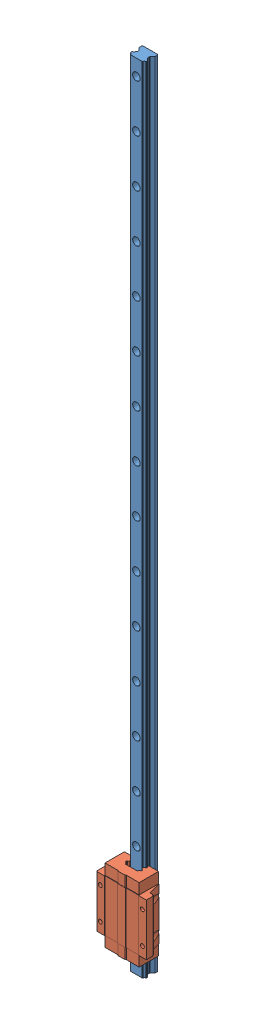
SolidWorks assembly HLW35HC1R1000 E=20.step.sldasm, configuration 默认 (file format 13000). Lengths in mm.
Overall size (63 1000 36.5).
2 component instances, 2 part files, 0 mates.
Components (placement in the parent):
- HLR35R1000 E=20-1: HLR35R1000 E=20.SLDPRT [默认] at origin size (20 1000 17.5)
- HLW35HC-1: HLW35HC.SLDPRT [默认] at (0 74.1 19) size (63 92.2 25.4)
